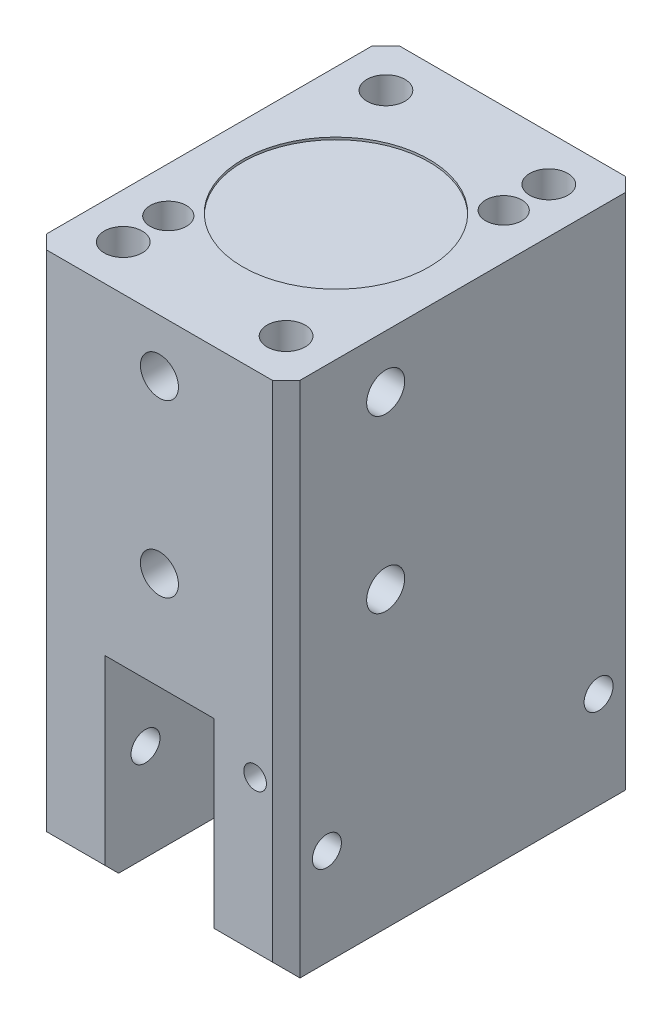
from build123d import *

# Parameters (mm, degrees)
SKETCH1_W                   = 27.9908
SKETCH1_H                   = 38.989
EXTRUDE1_DEPTH              = 28.575
M5_X_8_MOUNT_HOLES_D        = 4.2
M5_X_8_MOUNT_HOLES_DEPTH    = 8.9916
M5_X_8_MOUNT_HOLES_TIP      = 1.2618073
SKETCH5_R                   = 10.287
CUT_EXTRUDE1_DEPTH          = 0.254
SKETCH6_R                   = 2
F_4MM_DOWEL_SLIP_FIT_DEPTH  = 4.7625
M5_X_0_8_AIR_PORTS_D        = 4.2
M5_X_0_8_AIR_PORTS_DEPTH    = 11.9
M5_X_0_8_AIR_PORTS_TIP      = 1.2618073
M5_X_0_8_TAPPED_HOLE3_D     = 4.2
M5_X_0_8_TAPPED_HOLE3_DEPTH = 7.6
M5_X_0_8_TAPPED_HOLE3_TIP   = 1.2618073
SKETCH12_W                  = 12.065
SKETCH12_H                  = 21.59
CUT_EXTRUDE3_DEPTH          = 51.3243874
M5_X_0_8_MOUNT_HOLES_D      = 4.2
M5_X_0_8_MOUNT_HOLES_DEPTH  = 7.35
M5_X_0_8_MOUNT_HOLES_TIP    = 1.2618073
SKETCH15_R                  = 1.5
F_3MM_DOWEL_SLIP_FIT_DEPTH  = 5.08
SKETCH16_R                  = 1.6
CUT_EXTRUDE5_DEPTH          = 45.497764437
M3X0_5_TAPPED_HOLE1_D       = 2.5
M3X0_5_TAPPED_HOLE1_DEPTH   = 8
M3X0_5_TAPPED_HOLE1_TIP     = 0.751075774
CHAMFER1_SIZE               = 1.524
CHAMFER2_SIZE               = 1.524
M4X0_7_TAPPED_HOLE1_D       = 3.3
M4X0_7_TAPPED_HOLE1_DEPTH   = 12.3
M4X0_7_TAPPED_HOLE1_TIP     = 0.991420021
M3X0_5_TAPPED_HOLE2_D       = 2.5
M3X0_5_TAPPED_HOLE2_DEPTH   = 6.75
M3X0_5_TAPPED_HOLE2_TIP     = 0.751075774


with BuildPart() as part:
    # Sketch1 → Extrude1 (new, symmetric)
    with BuildSketch(Plane(origin=(0, 0, 0), x_dir=(1, 0, 0), z_dir=(0, 1, 0))):
        Rectangle(SKETCH1_W, SKETCH1_H)
    extrude(amount=EXTRUDE1_DEPTH, both=True)

    # M5 X .8 _Mount Holes
    with Locations(Plane(origin=(0, 28.575, 0), x_dir=(-1, 0, 0), z_dir=(0, 1, 0))):
        with Locations((-8.9916, -14.5034), (-8.9916, 14.5034), (8.9916, -14.5034), (8.9916, 14.5034)):
            Hole(M5_X_8_MOUNT_HOLES_D / 2, depth=M5_X_8_MOUNT_HOLES_DEPTH)
            with Locations((0, 0, -(M5_X_8_MOUNT_HOLES_DEPTH + M5_X_8_MOUNT_HOLES_TIP / 2))):  # 118° drill point
                Cone(0, M5_X_8_MOUNT_HOLES_D / 2, M5_X_8_MOUNT_HOLES_TIP, mode=Mode.SUBTRACT)

    # Sketch5 → Cut-Extrude1 (cut)
    with BuildSketch(Plane(origin=(0, 28.575, 0), x_dir=(-1, 0, 0), z_dir=(0, 1, 0))):
        with Locations(Location((0, 0, 0), (0, 0, 90))):
            Circle(SKETCH5_R)
    extrude(amount=-CUT_EXTRUDE1_DEPTH, mode=Mode.SUBTRACT)

    # Sketch6 → 4MM Dowel - Slip Fit (cut)
    with BuildSketch(Plane(origin=(0, 28.575, 0), x_dir=(-1, 0, 0), z_dir=(0, 1, 0))):
        with Locations(Location((8.9916, 9.525, 0), (0, 0, 90))):
            Circle(SKETCH6_R)
        with Locations(Location((-8.9916, -9.525, 0), (0, 0, 90))):
            Circle(SKETCH6_R)
    extrude(amount=-F_4MM_DOWEL_SLIP_FIT_DEPTH, mode=Mode.SUBTRACT)

    # M5 X 0.8 _Air Ports
    with Locations(Plane(origin=(13.9954, 0, 0), x_dir=(0, 0, -1), z_dir=(1, 0, 0))):
        with Locations((-8.509, 22.733), (-8.509, 3.8608)):
            Hole(M5_X_0_8_AIR_PORTS_D / 2, depth=M5_X_0_8_AIR_PORTS_DEPTH)
            with Locations((0, 0, -(M5_X_0_8_AIR_PORTS_DEPTH + M5_X_0_8_AIR_PORTS_TIP / 2))):  # 118° drill point
                Cone(0, M5_X_0_8_AIR_PORTS_D / 2, M5_X_0_8_AIR_PORTS_TIP, mode=Mode.SUBTRACT)

    # M5 X 0.8 Tapped Hole3
    with Locations(Plane.XY.offset(19.4945)):
        with Locations((0, 22.733), (0, 3.8608)):
            Hole(M5_X_0_8_TAPPED_HOLE3_D / 2, depth=M5_X_0_8_TAPPED_HOLE3_DEPTH)
            with Locations((0, 0, -(M5_X_0_8_TAPPED_HOLE3_DEPTH + M5_X_0_8_TAPPED_HOLE3_TIP / 2))):  # 118° drill point
                Cone(0, M5_X_0_8_TAPPED_HOLE3_D / 2, M5_X_0_8_TAPPED_HOLE3_TIP, mode=Mode.SUBTRACT)

    # Sketch12 → Cut-Extrude3 (cut, through all)
    with BuildSketch(Plane.XY.offset(19.4945)):
        with Locations((0, -17.78)):
            Rectangle(SKETCH12_W, SKETCH12_H)
    extrude(amount=-CUT_EXTRUDE3_DEPTH, mode=Mode.SUBTRACT)

    # M5 X 0.8 _Mount Holes
    with Locations(Plane.ZY.offset(13.9954)):
        with Locations((14.5034, 5.08), (14.5034, 23.5712), (-14.5034, 23.5712), (-14.5034, 5.08)):
            Hole(M5_X_0_8_MOUNT_HOLES_D / 2, depth=M5_X_0_8_MOUNT_HOLES_DEPTH)
            with Locations((0, 0, -(M5_X_0_8_MOUNT_HOLES_DEPTH + M5_X_0_8_MOUNT_HOLES_TIP / 2))):  # 118° drill point
                Cone(0, M5_X_0_8_MOUNT_HOLES_D / 2, M5_X_0_8_MOUNT_HOLES_TIP, mode=Mode.SUBTRACT)

    # Sketch15 → 3MM Dowel - Slip Fit (cut)
    with BuildSketch(Plane.ZY.offset(13.9954)):
        with Locations((-14.5034, 14.3256)):
            Circle(SKETCH15_R)
        with Locations((14.5034, 14.3256)):
            Circle(SKETCH15_R)
    extrude(amount=-F_3MM_DOWEL_SLIP_FIT_DEPTH, mode=Mode.SUBTRACT)

    # Sketch16 → Cut-Extrude5 (cut, through all)
    with BuildSketch(Plane.ZY.offset(13.9954)):
        with Locations((-14.9987, -17.907)):
            Circle(SKETCH16_R)
        with Locations((14.9987, -17.907)):
            Circle(SKETCH16_R)
    extrude(amount=-CUT_EXTRUDE5_DEPTH, mode=Mode.SUBTRACT)

    # M3x0.5 Tapped Hole1
    with Locations(Plane.XY.offset(19.4945)):
        with Locations((10.5664, -10.3378)):
            Hole(M3X0_5_TAPPED_HOLE1_D / 2, depth=M3X0_5_TAPPED_HOLE1_DEPTH)
            with Locations((0, 0, -(M3X0_5_TAPPED_HOLE1_DEPTH + M3X0_5_TAPPED_HOLE1_TIP / 2))):  # 118° drill point
                Cone(0, M3X0_5_TAPPED_HOLE1_D / 2, M3X0_5_TAPPED_HOLE1_TIP, mode=Mode.SUBTRACT)

    # Chamfer1
    chamfer1_edges = [part.edges().sort_by_distance(p)[0] for p in [
        (-13.9954, 0, -19.4945),
        (13.9954, 0, -19.4945),
        (13.9954, 0, 19.4945),
        (-13.9954, 0, 19.4945),
    ]]
    chamfer(chamfer1_edges, length=CHAMFER1_SIZE)

    # Chamfer2
    chamfer2_edges = [part.edges().sort_by_distance(p)[0] for p in [
        (9.25195, -28.575, 19.4945),
        (9.25195, -28.575, -19.4945),
        (-9.25195, -28.575, 19.4945),
        (-9.25195, -28.575, -19.4945),
    ]]
    chamfer(chamfer2_edges, length=CHAMFER2_SIZE)

    # M4x0.7 Tapped Hole1
    with Locations(Plane.XZ.offset(28.575)):
        with Locations((10.0203, 0), (-10.0203, 0)):
            Hole(M4X0_7_TAPPED_HOLE1_D / 2, depth=M4X0_7_TAPPED_HOLE1_DEPTH)
            with Locations((0, 0, -(M4X0_7_TAPPED_HOLE1_DEPTH + M4X0_7_TAPPED_HOLE1_TIP / 2))):  # 118° drill point
                Cone(0, M4X0_7_TAPPED_HOLE1_D / 2, M4X0_7_TAPPED_HOLE1_TIP, mode=Mode.SUBTRACT)

    # M3x0.5 Tapped Hole2
    with Locations(Plane.XZ.offset(28.575)):
        with Locations((10.5664, -14.7193)):
            Hole(M3X0_5_TAPPED_HOLE2_D / 2, depth=M3X0_5_TAPPED_HOLE2_DEPTH)
            with Locations((0, 0, -(M3X0_5_TAPPED_HOLE2_DEPTH + M3X0_5_TAPPED_HOLE2_TIP / 2))):  # 118° drill point
                Cone(0, M3X0_5_TAPPED_HOLE2_D / 2, M3X0_5_TAPPED_HOLE2_TIP, mode=Mode.SUBTRACT)


solid = part.part
